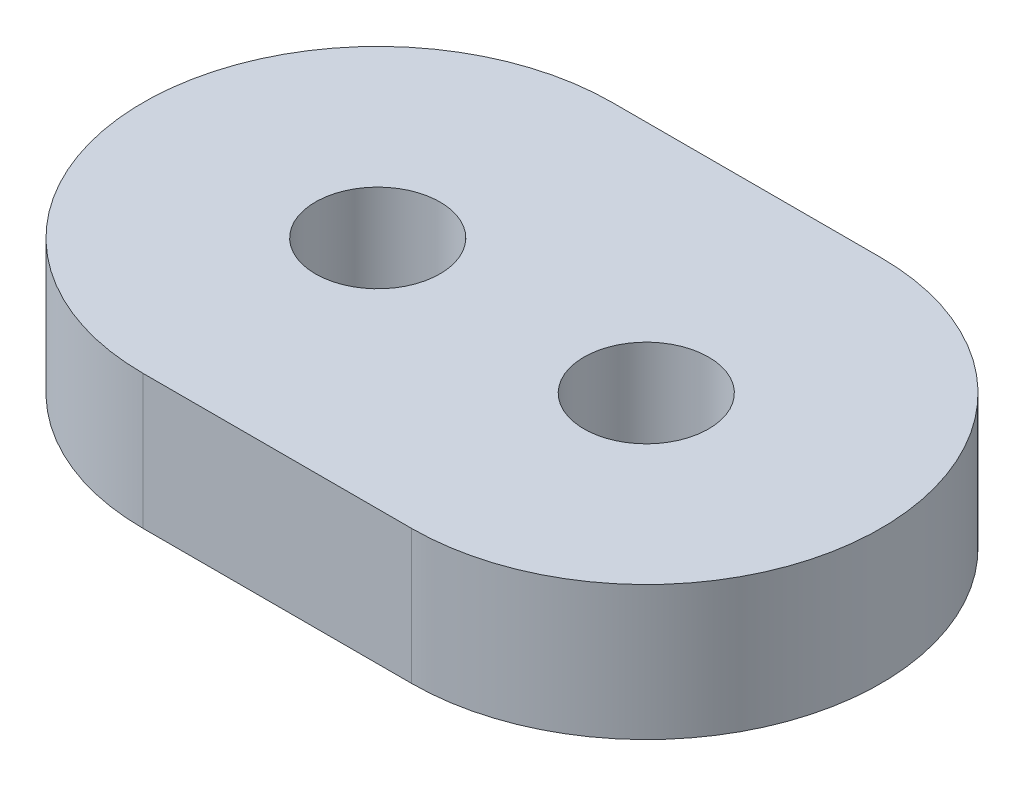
ISO-10303-21;
HEADER;
FILE_DESCRIPTION(('STEP AP214'),'2;1');
FILE_NAME('part.step','',(''),(''),'','','');
FILE_SCHEMA(('AUTOMOTIVE_DESIGN { 1 0 10303 214 1 1 1 1 }'));
ENDSEC;
DATA;
#1=APPLICATION_CONTEXT('core data for automotive mechanical design processes');
#2=APPLICATION_PROTOCOL_DEFINITION('international standard','automotive_design',2000,#1);
#3=PRODUCT_CONTEXT('',#1,'mechanical');
#4=PRODUCT('Part','Part','',(#3));
#5=PRODUCT_RELATED_PRODUCT_CATEGORY('part','',(#4));
#6=PRODUCT_DEFINITION_FORMATION('','',#4);
#7=PRODUCT_DEFINITION_CONTEXT('part definition',#1,'design');
#8=PRODUCT_DEFINITION('design','',#6,#7);
#9=PRODUCT_DEFINITION_SHAPE('','',#8);
#10=(LENGTH_UNIT() NAMED_UNIT(*) SI_UNIT(.MILLI.,.METRE.));
#11=(NAMED_UNIT(*) PLANE_ANGLE_UNIT() SI_UNIT($,.RADIAN.));
#12=(NAMED_UNIT(*) SI_UNIT($,.STERADIAN.) SOLID_ANGLE_UNIT());
#13=UNCERTAINTY_MEASURE_WITH_UNIT(LENGTH_MEASURE(1.E-05),#10,'distance_accuracy_value','');
#14=(GEOMETRIC_REPRESENTATION_CONTEXT(3) GLOBAL_UNCERTAINTY_ASSIGNED_CONTEXT((#13)) GLOBAL_UNIT_ASSIGNED_CONTEXT((#10,
#11,#12)) REPRESENTATION_CONTEXT('',''));
#15=CARTESIAN_POINT('',(0.,0.,0.));
#16=DIRECTION('',(0.,0.,1.));
#17=DIRECTION('',(1.,0.,0.));
#18=AXIS2_PLACEMENT_3D('',#15,#16,#17);
#19=CARTESIAN_POINT('',(3.175,3.175,-24.520410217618));
#20=DIRECTION('',(0.,1.,0.));
#21=DIRECTION('',(0.,0.,1.));
#22=AXIS2_PLACEMENT_3D('',#19,#20,#21);
#23=PLANE('',#22);
#24=CARTESIAN_POINT('',(3.175,3.175,-24.520410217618));
#25=DIRECTION('',(0.,-1.,0.));
#26=DIRECTION('',(0.,0.,-1.));
#27=AXIS2_PLACEMENT_3D('',#24,#25,#26);
#28=CIRCLE('',#27,1.4732);
#29=CARTESIAN_POINT('',(3.175,3.175,-25.993610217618));
#30=VERTEX_POINT('',#29);
#31=EDGE_CURVE('E140',#30,#30,#28,.T.);
#32=ORIENTED_EDGE('',*,*,#31,.T.);
#33=EDGE_LOOP('',(#32));
#34=FACE_BOUND('',#33,.T.);
#35=CARTESIAN_POINT('',(3.175,3.175,-24.520410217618));
#36=DIRECTION('',(0.,1.,0.));
#37=DIRECTION('',(0.,0.,1.));
#38=AXIS2_PLACEMENT_3D('',#35,#36,#37);
#39=CIRCLE('',#38,5.54687419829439);
#40=CARTESIAN_POINT('',(3.175,3.175,-18.9735360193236));
#41=VERTEX_POINT('',#40);
#42=CARTESIAN_POINT('',(3.175,3.175,-30.0672844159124));
#43=VERTEX_POINT('',#42);
#44=EDGE_CURVE('E111',#41,#43,#39,.T.);
#45=ORIENTED_EDGE('',*,*,#44,.T.);
#46=DIRECTION('',(-1.,0.,0.));
#47=VECTOR('',#46,1.);
#48=CARTESIAN_POINT('',(3.175,3.175,-30.0672844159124));
#49=LINE('',#48,#47);
#50=CARTESIAN_POINT('',(-3.17500000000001,3.175,-30.0672844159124));
#51=VERTEX_POINT('',#50);
#52=EDGE_CURVE('E104',#43,#51,#49,.T.);
#53=ORIENTED_EDGE('',*,*,#52,.T.);
#54=CARTESIAN_POINT('',(-3.17500000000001,3.175,-24.520410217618));
#55=DIRECTION('',(0.,1.,0.));
#56=DIRECTION('',(0.,0.,1.));
#57=AXIS2_PLACEMENT_3D('',#54,#55,#56);
#58=CIRCLE('',#57,5.54687419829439);
#59=CARTESIAN_POINT('',(-3.17500000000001,3.175,-18.9735360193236));
#60=VERTEX_POINT('',#59);
#61=EDGE_CURVE('E110',#51,#60,#58,.T.);
#62=ORIENTED_EDGE('',*,*,#61,.T.);
#63=DIRECTION('',(-1.,0.,0.));
#64=VECTOR('',#63,1.);
#65=CARTESIAN_POINT('',(3.175,3.175,-18.9735360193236));
#66=LINE('',#65,#64);
#67=EDGE_CURVE('E120',#41,#60,#66,.T.);
#68=ORIENTED_EDGE('',*,*,#67,.F.);
#69=EDGE_LOOP('',(#45,#53,#62,#68));
#70=FACE_BOUND('',#69,.T.);
#71=CARTESIAN_POINT('',(-3.17500000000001,3.175,-24.520410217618));
#72=DIRECTION('',(0.,1.,0.));
#73=DIRECTION('',(0.,0.,1.));
#74=AXIS2_PLACEMENT_3D('',#71,#72,#73);
#75=CIRCLE('',#74,1.4732);
#76=CARTESIAN_POINT('',(-3.17500000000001,3.175,-23.047210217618));
#77=VERTEX_POINT('',#76);
#78=EDGE_CURVE('E127',#77,#77,#75,.T.);
#79=ORIENTED_EDGE('',*,*,#78,.F.);
#80=EDGE_LOOP('',(#79));
#81=FACE_BOUND('',#80,.T.);
#82=ADVANCED_FACE('F61',(#34,#70,#81),#23,.T.);
#83=CARTESIAN_POINT('',(3.175,0.,-24.520410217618));
#84=DIRECTION('',(0.,1.,0.));
#85=DIRECTION('',(0.,0.,1.));
#86=AXIS2_PLACEMENT_3D('',#83,#84,#85);
#87=PLANE('',#86);
#88=CARTESIAN_POINT('',(3.175,0.,-24.520410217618));
#89=DIRECTION('',(0.,-1.,0.));
#90=DIRECTION('',(0.,0.,-1.));
#91=AXIS2_PLACEMENT_3D('',#88,#89,#90);
#92=CIRCLE('',#91,1.4732);
#93=CARTESIAN_POINT('',(3.175,0.,-25.993610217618));
#94=VERTEX_POINT('',#93);
#95=EDGE_CURVE('E143',#94,#94,#92,.T.);
#96=ORIENTED_EDGE('',*,*,#95,.F.);
#97=EDGE_LOOP('',(#96));
#98=FACE_BOUND('',#97,.T.);
#99=CARTESIAN_POINT('',(3.175,0.,-24.520410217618));
#100=DIRECTION('',(0.,1.,0.));
#101=DIRECTION('',(0.,0.,1.));
#102=AXIS2_PLACEMENT_3D('',#99,#100,#101);
#103=CIRCLE('',#102,5.54687419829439);
#104=CARTESIAN_POINT('',(3.175,0.,-18.9735360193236));
#105=VERTEX_POINT('',#104);
#106=CARTESIAN_POINT('',(3.175,0.,-30.0672844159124));
#107=VERTEX_POINT('',#106);
#108=EDGE_CURVE('E125',#105,#107,#103,.T.);
#109=ORIENTED_EDGE('',*,*,#108,.F.);
#110=DIRECTION('',(-1.,0.,0.));
#111=VECTOR('',#110,1.);
#112=CARTESIAN_POINT('',(3.175,0.,-18.9735360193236));
#113=LINE('',#112,#111);
#114=CARTESIAN_POINT('',(-3.17500000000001,0.,-18.9735360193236));
#115=VERTEX_POINT('',#114);
#116=EDGE_CURVE('E131',#105,#115,#113,.T.);
#117=ORIENTED_EDGE('',*,*,#116,.T.);
#118=CARTESIAN_POINT('',(-3.17500000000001,0.,-24.520410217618));
#119=DIRECTION('',(0.,1.,0.));
#120=DIRECTION('',(0.,0.,1.));
#121=AXIS2_PLACEMENT_3D('',#118,#119,#120);
#122=CIRCLE('',#121,5.54687419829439);
#123=CARTESIAN_POINT('',(-3.17500000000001,0.,-30.0672844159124));
#124=VERTEX_POINT('',#123);
#125=EDGE_CURVE('E129',#124,#115,#122,.T.);
#126=ORIENTED_EDGE('',*,*,#125,.F.);
#127=DIRECTION('',(-1.,0.,0.));
#128=VECTOR('',#127,1.);
#129=CARTESIAN_POINT('',(3.175,0.,-30.0672844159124));
#130=LINE('',#129,#128);
#131=EDGE_CURVE('E116',#107,#124,#130,.T.);
#132=ORIENTED_EDGE('',*,*,#131,.F.);
#133=EDGE_LOOP('',(#109,#117,#126,#132));
#134=FACE_BOUND('',#133,.T.);
#135=CARTESIAN_POINT('',(-3.17500000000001,0.,-24.520410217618));
#136=DIRECTION('',(0.,1.,0.));
#137=DIRECTION('',(0.,0.,1.));
#138=AXIS2_PLACEMENT_3D('',#135,#136,#137);
#139=CIRCLE('',#138,1.4732);
#140=CARTESIAN_POINT('',(-3.17500000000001,0.,-23.047210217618));
#141=VERTEX_POINT('',#140);
#142=EDGE_CURVE('E137',#141,#141,#139,.T.);
#143=ORIENTED_EDGE('',*,*,#142,.T.);
#144=EDGE_LOOP('',(#143));
#145=FACE_BOUND('',#144,.T.);
#146=ADVANCED_FACE('F157',(#98,#134,#145),#87,.F.);
#147=CARTESIAN_POINT('',(3.175,3.175,-24.520410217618));
#148=DIRECTION('',(0.,-1.,0.));
#149=DIRECTION('',(0.,0.,-1.));
#150=AXIS2_PLACEMENT_3D('',#147,#148,#149);
#151=CYLINDRICAL_SURFACE('',#150,5.54687419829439);
#152=ORIENTED_EDGE('',*,*,#108,.T.);
#153=DIRECTION('',(0.,-1.,0.));
#154=VECTOR('',#153,1.);
#155=CARTESIAN_POINT('',(3.175,3.175,-30.0672844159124));
#156=LINE('',#155,#154);
#157=EDGE_CURVE('E12',#43,#107,#156,.T.);
#158=ORIENTED_EDGE('',*,*,#157,.F.);
#159=ORIENTED_EDGE('',*,*,#44,.F.);
#160=DIRECTION('',(0.,-1.,0.));
#161=VECTOR('',#160,1.);
#162=CARTESIAN_POINT('',(3.175,3.175,-18.9735360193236));
#163=LINE('',#162,#161);
#164=EDGE_CURVE('E78',#41,#105,#163,.T.);
#165=ORIENTED_EDGE('',*,*,#164,.T.);
#166=EDGE_LOOP('',(#152,#158,#159,#165));
#167=FACE_BOUND('',#166,.T.);
#168=ADVANCED_FACE('F63',(#167),#151,.T.);
#169=CARTESIAN_POINT('',(3.175,3.175,-30.0672844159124));
#170=DIRECTION('',(0.,0.,1.));
#171=DIRECTION('',(1.,0.,0.));
#172=AXIS2_PLACEMENT_3D('',#169,#170,#171);
#173=PLANE('',#172);
#174=ORIENTED_EDGE('',*,*,#131,.T.);
#175=DIRECTION('',(0.,-1.,0.));
#176=VECTOR('',#175,1.);
#177=CARTESIAN_POINT('',(-3.17500000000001,3.175,-30.0672844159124));
#178=LINE('',#177,#176);
#179=EDGE_CURVE('E70',#51,#124,#178,.T.);
#180=ORIENTED_EDGE('',*,*,#179,.F.);
#181=ORIENTED_EDGE('',*,*,#52,.F.);
#182=ORIENTED_EDGE('',*,*,#157,.T.);
#183=EDGE_LOOP('',(#174,#180,#181,#182));
#184=FACE_BOUND('',#183,.T.);
#185=ADVANCED_FACE('F115',(#184),#173,.F.);
#186=CARTESIAN_POINT('',(-3.17500000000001,3.175,-24.520410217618));
#187=DIRECTION('',(0.,-1.,0.));
#188=DIRECTION('',(0.,0.,-1.));
#189=AXIS2_PLACEMENT_3D('',#186,#187,#188);
#190=CYLINDRICAL_SURFACE('',#189,5.54687419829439);
#191=ORIENTED_EDGE('',*,*,#125,.T.);
#192=DIRECTION('',(0.,-1.,0.));
#193=VECTOR('',#192,1.);
#194=CARTESIAN_POINT('',(-3.17500000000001,3.175,-18.9735360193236));
#195=LINE('',#194,#193);
#196=EDGE_CURVE('E93',#60,#115,#195,.T.);
#197=ORIENTED_EDGE('',*,*,#196,.F.);
#198=ORIENTED_EDGE('',*,*,#61,.F.);
#199=ORIENTED_EDGE('',*,*,#179,.T.);
#200=EDGE_LOOP('',(#191,#197,#198,#199));
#201=FACE_BOUND('',#200,.T.);
#202=ADVANCED_FACE('F119',(#201),#190,.T.);
#203=CARTESIAN_POINT('',(3.175,3.175,-18.9735360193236));
#204=DIRECTION('',(0.,0.,1.));
#205=DIRECTION('',(1.,0.,0.));
#206=AXIS2_PLACEMENT_3D('',#203,#204,#205);
#207=PLANE('',#206);
#208=ORIENTED_EDGE('',*,*,#116,.F.);
#209=ORIENTED_EDGE('',*,*,#164,.F.);
#210=ORIENTED_EDGE('',*,*,#67,.T.);
#211=ORIENTED_EDGE('',*,*,#196,.T.);
#212=EDGE_LOOP('',(#208,#209,#210,#211));
#213=FACE_BOUND('',#212,.T.);
#214=ADVANCED_FACE('F164',(#213),#207,.T.);
#215=CARTESIAN_POINT('',(-3.17500000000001,3.175,-24.520410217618));
#216=DIRECTION('',(0.,-1.,0.));
#217=DIRECTION('',(0.,0.,-1.));
#218=AXIS2_PLACEMENT_3D('',#215,#216,#217);
#219=CYLINDRICAL_SURFACE('',#218,1.4732);
#220=ORIENTED_EDGE('',*,*,#78,.T.);
#221=EDGE_LOOP('',(#220));
#222=FACE_BOUND('',#221,.T.);
#223=ORIENTED_EDGE('',*,*,#142,.F.);
#224=EDGE_LOOP('',(#223));
#225=FACE_BOUND('',#224,.T.);
#226=ADVANCED_FACE('F153',(#222,#225),#219,.F.);
#227=CARTESIAN_POINT('',(3.175,3.175,-24.520410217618));
#228=DIRECTION('',(0.,-1.,0.));
#229=DIRECTION('',(0.,0.,-1.));
#230=AXIS2_PLACEMENT_3D('',#227,#228,#229);
#231=CYLINDRICAL_SURFACE('',#230,1.4732);
#232=ORIENTED_EDGE('',*,*,#31,.F.);
#233=EDGE_LOOP('',(#232));
#234=FACE_BOUND('',#233,.T.);
#235=ORIENTED_EDGE('',*,*,#95,.T.);
#236=EDGE_LOOP('',(#235));
#237=FACE_BOUND('',#236,.T.);
#238=ADVANCED_FACE('F150',(#234,#237),#231,.F.);
#239=CLOSED_SHELL('',(#82,#146,#168,#185,#202,#214,#226,#238));
#240=MANIFOLD_SOLID_BREP('B2',#239);
#241=ADVANCED_BREP_SHAPE_REPRESENTATION('',(#18,#240),#14);
#242=SHAPE_DEFINITION_REPRESENTATION(#9,#241);
ENDSEC;
END-ISO-10303-21;
